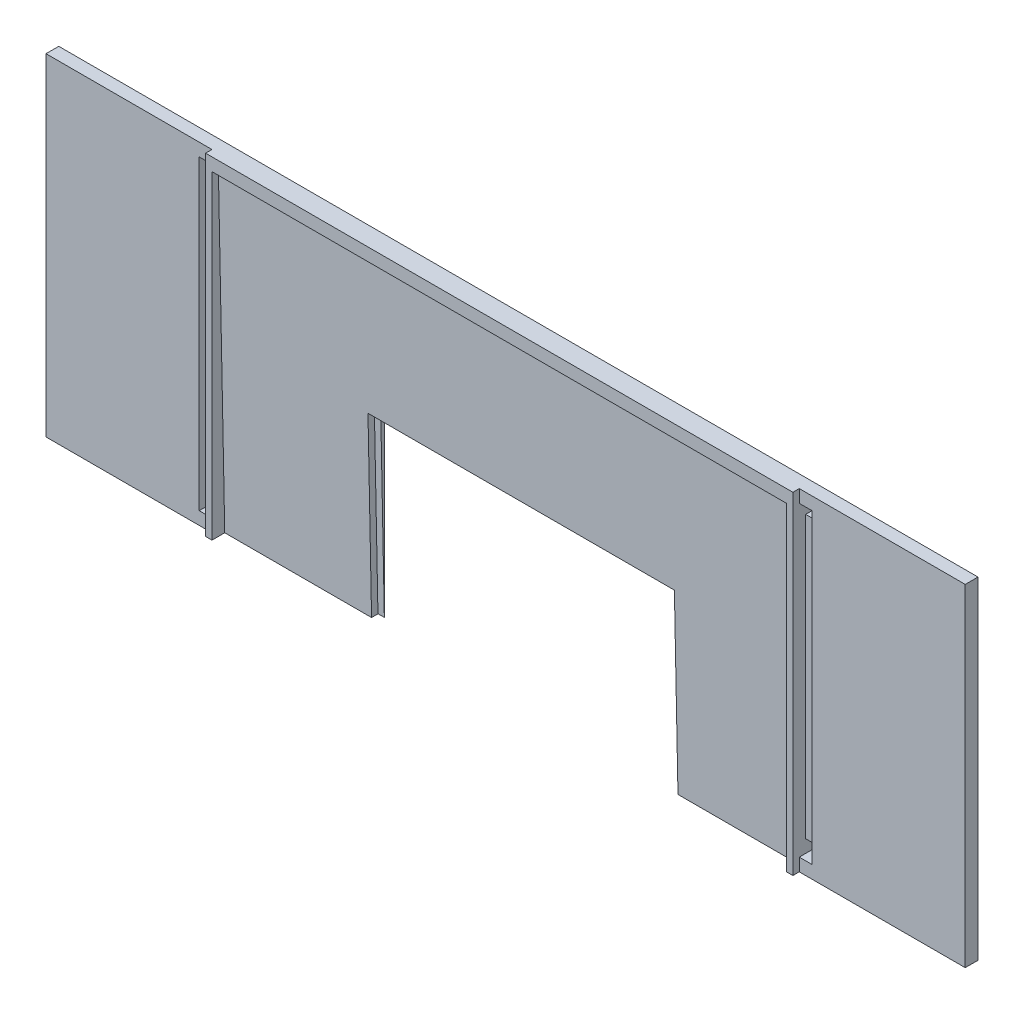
ISO-10303-21;
HEADER;
FILE_DESCRIPTION(('STEP AP214'),'2;1');
FILE_NAME('part.step','',(''),(''),'','','');
FILE_SCHEMA(('AUTOMOTIVE_DESIGN { 1 0 10303 214 1 1 1 1 }'));
ENDSEC;
DATA;
#1=APPLICATION_CONTEXT('core data for automotive mechanical design processes');
#2=APPLICATION_PROTOCOL_DEFINITION('international standard','automotive_design',2000,#1);
#3=PRODUCT_CONTEXT('',#1,'mechanical');
#4=PRODUCT('Part','Part','',(#3));
#5=PRODUCT_RELATED_PRODUCT_CATEGORY('part','',(#4));
#6=PRODUCT_DEFINITION_FORMATION('','',#4);
#7=PRODUCT_DEFINITION_CONTEXT('part definition',#1,'design');
#8=PRODUCT_DEFINITION('design','',#6,#7);
#9=PRODUCT_DEFINITION_SHAPE('','',#8);
#10=(LENGTH_UNIT() NAMED_UNIT(*) SI_UNIT(.MILLI.,.METRE.));
#11=(NAMED_UNIT(*) PLANE_ANGLE_UNIT() SI_UNIT($,.RADIAN.));
#12=(NAMED_UNIT(*) SI_UNIT($,.STERADIAN.) SOLID_ANGLE_UNIT());
#13=UNCERTAINTY_MEASURE_WITH_UNIT(LENGTH_MEASURE(1.E-05),#10,'distance_accuracy_value','');
#14=(GEOMETRIC_REPRESENTATION_CONTEXT(3) GLOBAL_UNCERTAINTY_ASSIGNED_CONTEXT((#13)) GLOBAL_UNIT_ASSIGNED_CONTEXT((#10,
#11,#12)) REPRESENTATION_CONTEXT('',''));
#15=CARTESIAN_POINT('',(0.,0.,0.));
#16=DIRECTION('',(0.,0.,1.));
#17=DIRECTION('',(1.,0.,0.));
#18=AXIS2_PLACEMENT_3D('',#15,#16,#17);
#19=CARTESIAN_POINT('',(0.,0.,-12.7));
#20=DIRECTION('',(0.,0.,1.));
#21=DIRECTION('',(1.,0.,0.));
#22=AXIS2_PLACEMENT_3D('',#19,#20,#21);
#23=PLANE('',#22);
#24=DIRECTION('',(0.,-1.,0.));
#25=VECTOR('',#24,1.);
#26=CARTESIAN_POINT('',(584.200000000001,304.8,-12.7));
#27=LINE('',#26,#25);
#28=CARTESIAN_POINT('',(584.200000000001,279.4,-12.7));
#29=VERTEX_POINT('',#28);
#30=CARTESIAN_POINT('',(584.2,-279.4,-12.7));
#31=VERTEX_POINT('',#30);
#32=EDGE_CURVE('E504',#29,#31,#27,.T.);
#33=ORIENTED_EDGE('',*,*,#32,.T.);
#34=DIRECTION('',(1.,0.,0.));
#35=VECTOR('',#34,1.);
#36=CARTESIAN_POINT('',(609.6,-279.4,-12.7));
#37=LINE('',#36,#35);
#38=CARTESIAN_POINT('',(609.6,-279.4,-12.7));
#39=VERTEX_POINT('',#38);
#40=EDGE_CURVE('E339',#31,#39,#37,.T.);
#41=ORIENTED_EDGE('',*,*,#40,.T.);
#42=DIRECTION('',(0.,1.,0.));
#43=VECTOR('',#42,1.);
#44=CARTESIAN_POINT('',(609.6,304.8,-12.7));
#45=LINE('',#44,#43);
#46=CARTESIAN_POINT('',(609.6,279.4,-12.7));
#47=VERTEX_POINT('',#46);
#48=EDGE_CURVE('E507',#39,#47,#45,.T.);
#49=ORIENTED_EDGE('',*,*,#48,.T.);
#50=DIRECTION('',(-1.,0.,0.));
#51=VECTOR('',#50,1.);
#52=CARTESIAN_POINT('',(609.6,279.4,-12.7));
#53=LINE('',#52,#51);
#54=EDGE_CURVE('E396',#47,#29,#53,.T.);
#55=ORIENTED_EDGE('',*,*,#54,.T.);
#56=EDGE_LOOP('',(#33,#41,#49,#55));
#57=FACE_BOUND('',#56,.T.);
#58=ADVANCED_FACE('F40',(#57),#23,.T.);
#59=CARTESIAN_POINT('',(330.2,-330.2,-25.4));
#60=DIRECTION('',(0.,-1.,0.));
#61=DIRECTION('',(0.,0.,-1.));
#62=AXIS2_PLACEMENT_3D('',#59,#60,#61);
#63=PLANE('',#62);
#64=DIRECTION('',(0.,0.,-1.));
#65=VECTOR('',#64,1.);
#66=CARTESIAN_POINT('',(571.5,-330.2,12.7));
#67=LINE('',#66,#65);
#68=CARTESIAN_POINT('',(571.5,-330.2,12.7));
#69=VERTEX_POINT('',#68);
#70=CARTESIAN_POINT('',(571.5,-330.2,-12.7));
#71=VERTEX_POINT('',#70);
#72=EDGE_CURVE('E464',#69,#71,#67,.T.);
#73=ORIENTED_EDGE('',*,*,#72,.T.);
#74=DIRECTION('',(-1.,0.,0.));
#75=VECTOR('',#74,1.);
#76=CARTESIAN_POINT('',(571.5,-330.2,-12.7));
#77=LINE('',#76,#75);
#78=CARTESIAN_POINT('',(330.2,-330.2,-12.7));
#79=VERTEX_POINT('',#78);
#80=EDGE_CURVE('E419',#71,#79,#77,.T.);
#81=ORIENTED_EDGE('',*,*,#80,.T.);
#82=DIRECTION('',(0.,0.,1.));
#83=VECTOR('',#82,1.);
#84=CARTESIAN_POINT('',(330.2,-330.2,-25.4));
#85=LINE('',#84,#83);
#86=CARTESIAN_POINT('',(330.2,-330.2,-25.4));
#87=VERTEX_POINT('',#86);
#88=EDGE_CURVE('E560',#87,#79,#85,.T.);
#89=ORIENTED_EDGE('',*,*,#88,.F.);
#90=DIRECTION('',(1.,0.,0.));
#91=VECTOR('',#90,1.);
#92=CARTESIAN_POINT('',(330.2,-330.2,-25.4));
#93=LINE('',#92,#91);
#94=CARTESIAN_POINT('',(914.4,-330.2,-25.4));
#95=VERTEX_POINT('',#94);
#96=EDGE_CURVE('E543',#87,#95,#93,.T.);
#97=ORIENTED_EDGE('',*,*,#96,.T.);
#98=DIRECTION('',(0.,0.,1.));
#99=VECTOR('',#98,1.);
#100=CARTESIAN_POINT('',(914.4,-330.2,-25.4));
#101=LINE('',#100,#99);
#102=CARTESIAN_POINT('',(914.4,-330.2,0.));
#103=VERTEX_POINT('',#102);
#104=EDGE_CURVE('E557',#95,#103,#101,.T.);
#105=ORIENTED_EDGE('',*,*,#104,.T.);
#106=DIRECTION('',(1.,0.,0.));
#107=VECTOR('',#106,1.);
#108=CARTESIAN_POINT('',(330.2,-330.2,0.));
#109=LINE('',#108,#107);
#110=CARTESIAN_POINT('',(584.200000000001,-330.2,0.));
#111=VERTEX_POINT('',#110);
#112=EDGE_CURVE('E530',#111,#103,#109,.T.);
#113=ORIENTED_EDGE('',*,*,#112,.F.);
#114=DIRECTION('',(0.,0.,-1.));
#115=VECTOR('',#114,1.);
#116=CARTESIAN_POINT('',(584.200000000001,-330.2,12.7));
#117=LINE('',#116,#115);
#118=CARTESIAN_POINT('',(584.200000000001,-330.2,12.7));
#119=VERTEX_POINT('',#118);
#120=EDGE_CURVE('E461',#119,#111,#117,.T.);
#121=ORIENTED_EDGE('',*,*,#120,.F.);
#122=DIRECTION('',(1.,0.,0.));
#123=VECTOR('',#122,1.);
#124=CARTESIAN_POINT('',(571.5,-330.2,12.7));
#125=LINE('',#124,#123);
#126=EDGE_CURVE('E443',#69,#119,#125,.T.);
#127=ORIENTED_EDGE('',*,*,#126,.F.);
#128=EDGE_LOOP('',(#73,#81,#89,#97,#105,#113,#121,#127));
#129=FACE_BOUND('',#128,.T.);
#130=ADVANCED_FACE('F591',(#129),#63,.T.);
#131=CARTESIAN_POINT('',(330.2,-330.2,-25.4));
#132=DIRECTION('',(-1.,0.,0.));
#133=DIRECTION('',(0.,0.,1.));
#134=AXIS2_PLACEMENT_3D('',#131,#132,#133);
#135=PLANE('',#134);
#136=DIRECTION('',(0.,0.999800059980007,0.0199960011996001));
#137=VECTOR('',#136,1.);
#138=CARTESIAN_POINT('',(330.2,25.6539492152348,-18.2854607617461));
#139=LINE('',#138,#137);
#140=CARTESIAN_POINT('',(330.2,-329.946050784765,-25.3974607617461));
#141=VERTEX_POINT('',#140);
#142=CARTESIAN_POINT('',(330.2,25.3999999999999,-18.2905397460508));
#143=VERTEX_POINT('',#142);
#144=EDGE_CURVE('E58',#141,#143,#139,.T.);
#145=ORIENTED_EDGE('',*,*,#144,.F.);
#146=DIRECTION('',(0.,-0.0199960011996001,0.999800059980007));
#147=VECTOR('',#146,1.);
#148=CARTESIAN_POINT('',(330.2,-315.760851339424,-734.657433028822));
#149=LINE('',#148,#147);
#150=CARTESIAN_POINT('',(330.2,-329.946,-25.4));
#151=VERTEX_POINT('',#150);
#152=EDGE_CURVE('E325',#151,#141,#149,.T.);
#153=ORIENTED_EDGE('',*,*,#152,.F.);
#154=DIRECTION('',(0.,-1.,0.));
#155=VECTOR('',#154,1.);
#156=CARTESIAN_POINT('',(330.2,-330.2,-25.4));
#157=LINE('',#156,#155);
#158=EDGE_CURVE('E541',#151,#87,#157,.T.);
#159=ORIENTED_EDGE('',*,*,#158,.T.);
#160=ORIENTED_EDGE('',*,*,#88,.T.);
#161=DIRECTION('',(0.,0.999800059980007,0.0199960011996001));
#162=VECTOR('',#161,1.);
#163=CARTESIAN_POINT('',(330.2,-330.453898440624,-12.7050779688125));
#164=LINE('',#163,#162);
#165=CARTESIAN_POINT('',(330.2,25.3999999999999,-5.588));
#166=VERTEX_POINT('',#165);
#167=EDGE_CURVE('E428',#79,#166,#164,.T.);
#168=ORIENTED_EDGE('',*,*,#167,.T.);
#169=DIRECTION('',(0.,0.,1.));
#170=VECTOR('',#169,1.);
#171=CARTESIAN_POINT('',(330.2,25.3999999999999,-25.4));
#172=LINE('',#171,#170);
#173=EDGE_CURVE('E563',#143,#166,#172,.T.);
#174=ORIENTED_EDGE('',*,*,#173,.F.);
#175=EDGE_LOOP('',(#145,#153,#159,#160,#168,#174));
#176=FACE_BOUND('',#175,.T.);
#177=ADVANCED_FACE('F651',(#176),#135,.T.);
#178=CARTESIAN_POINT('',(-279.4,25.3999999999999,-25.4));
#179=DIRECTION('',(0.,-1.,0.));
#180=DIRECTION('',(0.,0.,-1.));
#181=AXIS2_PLACEMENT_3D('',#178,#179,#180);
#182=PLANE('',#181);
#183=DIRECTION('',(-1.,0.,0.));
#184=VECTOR('',#183,1.);
#185=CARTESIAN_POINT('',(-279.4,25.3999999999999,-18.2905397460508));
#186=LINE('',#185,#184);
#187=CARTESIAN_POINT('',(-279.4,25.3999999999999,-18.2905397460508));
#188=VERTEX_POINT('',#187);
#189=EDGE_CURVE('E66',#143,#188,#186,.T.);
#190=ORIENTED_EDGE('',*,*,#189,.F.);
#191=ORIENTED_EDGE('',*,*,#173,.T.);
#192=DIRECTION('',(-1.,0.,0.));
#193=VECTOR('',#192,1.);
#194=CARTESIAN_POINT('',(-279.4,25.3999999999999,-5.588));
#195=LINE('',#194,#193);
#196=CARTESIAN_POINT('',(-279.4,25.3999999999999,-5.588));
#197=VERTEX_POINT('',#196);
#198=EDGE_CURVE('E425',#166,#197,#195,.T.);
#199=ORIENTED_EDGE('',*,*,#198,.T.);
#200=DIRECTION('',(0.,0.,1.));
#201=VECTOR('',#200,1.);
#202=CARTESIAN_POINT('',(-279.4,25.3999999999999,-25.4));
#203=LINE('',#202,#201);
#204=EDGE_CURVE('E565',#188,#197,#203,.T.);
#205=ORIENTED_EDGE('',*,*,#204,.F.);
#206=EDGE_LOOP('',(#190,#191,#199,#205));
#207=FACE_BOUND('',#206,.T.);
#208=ADVANCED_FACE('F650',(#207),#182,.T.);
#209=CARTESIAN_POINT('',(-279.4,-330.2,-25.4));
#210=DIRECTION('',(1.,0.,0.));
#211=DIRECTION('',(0.,0.,-1.));
#212=AXIS2_PLACEMENT_3D('',#209,#210,#211);
#213=PLANE('',#212);
#214=DIRECTION('',(0.,-0.999800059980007,-0.0199960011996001));
#215=VECTOR('',#214,1.);
#216=CARTESIAN_POINT('',(-279.4,25.6539492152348,-18.2854607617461));
#217=LINE('',#216,#215);
#218=CARTESIAN_POINT('',(-279.4,-329.946050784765,-25.3974607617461));
#219=VERTEX_POINT('',#218);
#220=EDGE_CURVE('E320',#188,#219,#217,.T.);
#221=ORIENTED_EDGE('',*,*,#220,.F.);
#222=ORIENTED_EDGE('',*,*,#204,.T.);
#223=DIRECTION('',(0.,-0.999800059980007,-0.0199960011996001));
#224=VECTOR('',#223,1.);
#225=CARTESIAN_POINT('',(-279.4,-330.453898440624,-12.7050779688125));
#226=LINE('',#225,#224);
#227=CARTESIAN_POINT('',(-279.4,-330.2,-12.7));
#228=VERTEX_POINT('',#227);
#229=EDGE_CURVE('E422',#197,#228,#226,.T.);
#230=ORIENTED_EDGE('',*,*,#229,.T.);
#231=DIRECTION('',(0.,0.,1.));
#232=VECTOR('',#231,1.);
#233=CARTESIAN_POINT('',(-279.4,-330.2,-25.4));
#234=LINE('',#233,#232);
#235=CARTESIAN_POINT('',(-279.4,-330.2,-25.4));
#236=VERTEX_POINT('',#235);
#237=EDGE_CURVE('E567',#236,#228,#234,.T.);
#238=ORIENTED_EDGE('',*,*,#237,.F.);
#239=DIRECTION('',(0.,1.,0.));
#240=VECTOR('',#239,1.);
#241=CARTESIAN_POINT('',(-279.4,-330.2,-25.4));
#242=LINE('',#241,#240);
#243=CARTESIAN_POINT('',(-279.4,-329.946,-25.4));
#244=VERTEX_POINT('',#243);
#245=EDGE_CURVE('E539',#236,#244,#242,.T.);
#246=ORIENTED_EDGE('',*,*,#245,.T.);
#247=DIRECTION('',(0.,-0.0199960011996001,0.999800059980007));
#248=VECTOR('',#247,1.);
#249=CARTESIAN_POINT('',(-279.4,-315.760851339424,-734.657433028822));
#250=LINE('',#249,#248);
#251=EDGE_CURVE('E314',#244,#219,#250,.T.);
#252=ORIENTED_EDGE('',*,*,#251,.T.);
#253=EDGE_LOOP('',(#221,#222,#230,#238,#246,#252));
#254=FACE_BOUND('',#253,.T.);
#255=ADVANCED_FACE('F649',(#254),#213,.T.);
#256=CARTESIAN_POINT('',(-914.4,-330.2,-25.4));
#257=DIRECTION('',(0.,-1.,0.));
#258=DIRECTION('',(0.,0.,-1.));
#259=AXIS2_PLACEMENT_3D('',#256,#257,#258);
#260=PLANE('',#259);
#261=ORIENTED_EDGE('',*,*,#237,.T.);
#262=CARTESIAN_POINT('',(-571.5,-330.2,-12.7));
#263=VERTEX_POINT('',#262);
#264=EDGE_CURVE('E417',#228,#263,#77,.T.);
#265=ORIENTED_EDGE('',*,*,#264,.T.);
#266=DIRECTION('',(0.,0.,-1.));
#267=VECTOR('',#266,1.);
#268=CARTESIAN_POINT('',(-571.5,-330.2,12.7));
#269=LINE('',#268,#267);
#270=CARTESIAN_POINT('',(-571.5,-330.2,12.7));
#271=VERTEX_POINT('',#270);
#272=EDGE_CURVE('E472',#271,#263,#269,.T.);
#273=ORIENTED_EDGE('',*,*,#272,.F.);
#274=DIRECTION('',(1.,0.,0.));
#275=VECTOR('',#274,1.);
#276=CARTESIAN_POINT('',(-584.2,-330.2,12.7));
#277=LINE('',#276,#275);
#278=CARTESIAN_POINT('',(-584.2,-330.2,12.7));
#279=VERTEX_POINT('',#278);
#280=EDGE_CURVE('E434',#279,#271,#277,.T.);
#281=ORIENTED_EDGE('',*,*,#280,.F.);
#282=DIRECTION('',(0.,0.,-1.));
#283=VECTOR('',#282,1.);
#284=CARTESIAN_POINT('',(-584.2,-330.2,12.7));
#285=LINE('',#284,#283);
#286=CARTESIAN_POINT('',(-584.2,-330.2,0.));
#287=VERTEX_POINT('',#286);
#288=EDGE_CURVE('E474',#279,#287,#285,.T.);
#289=ORIENTED_EDGE('',*,*,#288,.T.);
#290=DIRECTION('',(1.,0.,0.));
#291=VECTOR('',#290,1.);
#292=CARTESIAN_POINT('',(-914.4,-330.2,0.));
#293=LINE('',#292,#291);
#294=CARTESIAN_POINT('',(-914.4,-330.2,0.));
#295=VERTEX_POINT('',#294);
#296=EDGE_CURVE('E554',#295,#287,#293,.T.);
#297=ORIENTED_EDGE('',*,*,#296,.F.);
#298=DIRECTION('',(0.,0.,1.));
#299=VECTOR('',#298,1.);
#300=CARTESIAN_POINT('',(-914.4,-330.2,-25.4));
#301=LINE('',#300,#299);
#302=CARTESIAN_POINT('',(-914.4,-330.2,-25.4));
#303=VERTEX_POINT('',#302);
#304=EDGE_CURVE('E570',#303,#295,#301,.T.);
#305=ORIENTED_EDGE('',*,*,#304,.F.);
#306=DIRECTION('',(1.,0.,0.));
#307=VECTOR('',#306,1.);
#308=CARTESIAN_POINT('',(-914.4,-330.2,-25.4));
#309=LINE('',#308,#307);
#310=EDGE_CURVE('E536',#303,#236,#309,.T.);
#311=ORIENTED_EDGE('',*,*,#310,.T.);
#312=EDGE_LOOP('',(#261,#265,#273,#281,#289,#297,#305,#311));
#313=FACE_BOUND('',#312,.T.);
#314=ADVANCED_FACE('F646',(#313),#260,.T.);
#315=CARTESIAN_POINT('',(0.,0.,0.));
#316=DIRECTION('',(0.,0.,-1.));
#317=DIRECTION('',(-1.,0.,0.));
#318=AXIS2_PLACEMENT_3D('',#315,#316,#317);
#319=PLANE('',#318);
#320=DIRECTION('',(0.,-1.,0.));
#321=VECTOR('',#320,1.);
#322=CARTESIAN_POINT('',(-584.2,330.2,0.));
#323=LINE('',#322,#321);
#324=CARTESIAN_POINT('',(-584.2,330.2,0.));
#325=VERTEX_POINT('',#324);
#326=CARTESIAN_POINT('',(-584.2,304.8,0.));
#327=VERTEX_POINT('',#326);
#328=EDGE_CURVE('E51',#325,#327,#323,.T.);
#329=ORIENTED_EDGE('',*,*,#328,.F.);
#330=DIRECTION('',(-1.,0.,0.));
#331=VECTOR('',#330,1.);
#332=CARTESIAN_POINT('',(-914.4,330.2,0.));
#333=LINE('',#332,#331);
#334=CARTESIAN_POINT('',(-914.4,330.2,0.));
#335=VERTEX_POINT('',#334);
#336=EDGE_CURVE('E548',#325,#335,#333,.T.);
#337=ORIENTED_EDGE('',*,*,#336,.T.);
#338=DIRECTION('',(0.,-1.,0.));
#339=VECTOR('',#338,1.);
#340=CARTESIAN_POINT('',(-914.4,-330.2,0.));
#341=LINE('',#340,#339);
#342=EDGE_CURVE('E551',#335,#295,#341,.T.);
#343=ORIENTED_EDGE('',*,*,#342,.T.);
#344=ORIENTED_EDGE('',*,*,#296,.T.);
#345=CARTESIAN_POINT('',(-584.2,-304.8,0.));
#346=VERTEX_POINT('',#345);
#347=EDGE_CURVE('E11',#346,#287,#323,.T.);
#348=ORIENTED_EDGE('',*,*,#347,.F.);
#349=DIRECTION('',(1.,0.,0.));
#350=VECTOR('',#349,1.);
#351=CARTESIAN_POINT('',(-609.6,-304.8,0.));
#352=LINE('',#351,#350);
#353=CARTESIAN_POINT('',(-609.6,-304.8,0.));
#354=VERTEX_POINT('',#353);
#355=EDGE_CURVE('E488',#354,#346,#352,.T.);
#356=ORIENTED_EDGE('',*,*,#355,.F.);
#357=DIRECTION('',(0.,-1.,0.));
#358=VECTOR('',#357,1.);
#359=CARTESIAN_POINT('',(-609.6,-304.8,0.));
#360=LINE('',#359,#358);
#361=CARTESIAN_POINT('',(-609.6,304.8,0.));
#362=VERTEX_POINT('',#361);
#363=EDGE_CURVE('E486',#362,#354,#360,.T.);
#364=ORIENTED_EDGE('',*,*,#363,.F.);
#365=DIRECTION('',(-1.,0.,0.));
#366=VECTOR('',#365,1.);
#367=CARTESIAN_POINT('',(-609.6,304.8,0.));
#368=LINE('',#367,#366);
#369=EDGE_CURVE('E482',#327,#362,#368,.T.);
#370=ORIENTED_EDGE('',*,*,#369,.F.);
#371=EDGE_LOOP('',(#329,#337,#343,#344,#348,#356,#364,#370));
#372=FACE_BOUND('',#371,.T.);
#373=ADVANCED_FACE('F600',(#372),#319,.F.);
#374=DIRECTION('',(0.,1.,0.));
#375=VECTOR('',#374,1.);
#376=CARTESIAN_POINT('',(584.200000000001,330.2,0.));
#377=LINE('',#376,#375);
#378=CARTESIAN_POINT('',(584.200000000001,-304.8,0.));
#379=VERTEX_POINT('',#378);
#380=EDGE_CURVE('E435',#111,#379,#377,.T.);
#381=ORIENTED_EDGE('',*,*,#380,.F.);
#382=ORIENTED_EDGE('',*,*,#112,.T.);
#383=DIRECTION('',(0.,1.,0.));
#384=VECTOR('',#383,1.);
#385=CARTESIAN_POINT('',(914.4,-330.2,0.));
#386=LINE('',#385,#384);
#387=CARTESIAN_POINT('',(914.4,330.2,0.));
#388=VERTEX_POINT('',#387);
#389=EDGE_CURVE('E496',#103,#388,#386,.T.);
#390=ORIENTED_EDGE('',*,*,#389,.T.);
#391=CARTESIAN_POINT('',(584.200000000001,330.2,0.));
#392=VERTEX_POINT('',#391);
#393=EDGE_CURVE('E549',#388,#392,#333,.T.);
#394=ORIENTED_EDGE('',*,*,#393,.T.);
#395=CARTESIAN_POINT('',(584.200000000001,304.8,0.));
#396=VERTEX_POINT('',#395);
#397=EDGE_CURVE('E49',#396,#392,#377,.T.);
#398=ORIENTED_EDGE('',*,*,#397,.F.);
#399=DIRECTION('',(-1.,0.,0.));
#400=VECTOR('',#399,1.);
#401=CARTESIAN_POINT('',(584.200000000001,304.8,0.));
#402=LINE('',#401,#400);
#403=CARTESIAN_POINT('',(609.6,304.8,0.));
#404=VERTEX_POINT('',#403);
#405=EDGE_CURVE('E508',#404,#396,#402,.T.);
#406=ORIENTED_EDGE('',*,*,#405,.F.);
#407=DIRECTION('',(0.,1.,0.));
#408=VECTOR('',#407,1.);
#409=CARTESIAN_POINT('',(609.6,304.8,0.));
#410=LINE('',#409,#408);
#411=CARTESIAN_POINT('',(609.6,-304.8,0.));
#412=VERTEX_POINT('',#411);
#413=EDGE_CURVE('E514',#412,#404,#410,.T.);
#414=ORIENTED_EDGE('',*,*,#413,.F.);
#415=DIRECTION('',(1.,0.,0.));
#416=VECTOR('',#415,1.);
#417=CARTESIAN_POINT('',(584.200000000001,-304.8,0.));
#418=LINE('',#417,#416);
#419=EDGE_CURVE('E477',#379,#412,#418,.T.);
#420=ORIENTED_EDGE('',*,*,#419,.F.);
#421=EDGE_LOOP('',(#381,#382,#390,#394,#398,#406,#414,#420));
#422=FACE_BOUND('',#421,.T.);
#423=ADVANCED_FACE('F586',(#422),#319,.F.);
#424=CARTESIAN_POINT('',(914.4,-330.2,-25.4));
#425=DIRECTION('',(1.,0.,0.));
#426=DIRECTION('',(0.,0.,-1.));
#427=AXIS2_PLACEMENT_3D('',#424,#425,#426);
#428=PLANE('',#427);
#429=ORIENTED_EDGE('',*,*,#389,.F.);
#430=ORIENTED_EDGE('',*,*,#104,.F.);
#431=DIRECTION('',(0.,1.,0.));
#432=VECTOR('',#431,1.);
#433=CARTESIAN_POINT('',(914.4,-330.2,-25.4));
#434=LINE('',#433,#432);
#435=CARTESIAN_POINT('',(914.4,330.2,-25.4));
#436=VERTEX_POINT('',#435);
#437=EDGE_CURVE('E526',#95,#436,#434,.T.);
#438=ORIENTED_EDGE('',*,*,#437,.T.);
#439=DIRECTION('',(0.,0.,1.));
#440=VECTOR('',#439,1.);
#441=CARTESIAN_POINT('',(914.4,330.2,-25.4));
#442=LINE('',#441,#440);
#443=EDGE_CURVE('E44',#436,#388,#442,.T.);
#444=ORIENTED_EDGE('',*,*,#443,.T.);
#445=EDGE_LOOP('',(#429,#430,#438,#444));
#446=FACE_BOUND('',#445,.T.);
#447=ADVANCED_FACE('F42',(#446),#428,.T.);
#448=CARTESIAN_POINT('',(-914.4,-330.2,-25.4));
#449=DIRECTION('',(-1.,0.,0.));
#450=DIRECTION('',(0.,0.,1.));
#451=AXIS2_PLACEMENT_3D('',#448,#449,#450);
#452=PLANE('',#451);
#453=ORIENTED_EDGE('',*,*,#342,.F.);
#454=DIRECTION('',(0.,0.,1.));
#455=VECTOR('',#454,1.);
#456=CARTESIAN_POINT('',(-914.4,330.2,-25.4));
#457=LINE('',#456,#455);
#458=CARTESIAN_POINT('',(-914.4,330.2,-25.4));
#459=VERTEX_POINT('',#458);
#460=EDGE_CURVE('E571',#459,#335,#457,.T.);
#461=ORIENTED_EDGE('',*,*,#460,.F.);
#462=DIRECTION('',(0.,-1.,0.));
#463=VECTOR('',#462,1.);
#464=CARTESIAN_POINT('',(-914.4,-330.2,-25.4));
#465=LINE('',#464,#463);
#466=EDGE_CURVE('E533',#459,#303,#465,.T.);
#467=ORIENTED_EDGE('',*,*,#466,.T.);
#468=ORIENTED_EDGE('',*,*,#304,.T.);
#469=EDGE_LOOP('',(#453,#461,#467,#468));
#470=FACE_BOUND('',#469,.T.);
#471=ADVANCED_FACE('F597',(#470),#452,.T.);
#472=CARTESIAN_POINT('',(-914.4,330.2,-25.4));
#473=DIRECTION('',(0.,1.,0.));
#474=DIRECTION('',(0.,0.,1.));
#475=AXIS2_PLACEMENT_3D('',#472,#473,#474);
#476=PLANE('',#475);
#477=ORIENTED_EDGE('',*,*,#393,.F.);
#478=ORIENTED_EDGE('',*,*,#443,.F.);
#479=DIRECTION('',(-1.,0.,0.));
#480=VECTOR('',#479,1.);
#481=CARTESIAN_POINT('',(-914.4,330.2,-25.4));
#482=LINE('',#481,#480);
#483=EDGE_CURVE('E529',#436,#459,#482,.T.);
#484=ORIENTED_EDGE('',*,*,#483,.T.);
#485=ORIENTED_EDGE('',*,*,#460,.T.);
#486=ORIENTED_EDGE('',*,*,#336,.F.);
#487=DIRECTION('',(0.,0.,-1.));
#488=VECTOR('',#487,1.);
#489=CARTESIAN_POINT('',(-584.2,330.2,12.7));
#490=LINE('',#489,#488);
#491=CARTESIAN_POINT('',(-584.2,330.2,12.7));
#492=VERTEX_POINT('',#491);
#493=EDGE_CURVE('E448',#492,#325,#490,.T.);
#494=ORIENTED_EDGE('',*,*,#493,.F.);
#495=DIRECTION('',(-1.,0.,0.));
#496=VECTOR('',#495,1.);
#497=CARTESIAN_POINT('',(-584.2,330.2,12.7));
#498=LINE('',#497,#496);
#499=CARTESIAN_POINT('',(584.200000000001,330.2,12.7));
#500=VERTEX_POINT('',#499);
#501=EDGE_CURVE('E447',#500,#492,#498,.T.);
#502=ORIENTED_EDGE('',*,*,#501,.F.);
#503=DIRECTION('',(0.,0.,-1.));
#504=VECTOR('',#503,1.);
#505=CARTESIAN_POINT('',(584.200000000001,330.2,12.7));
#506=LINE('',#505,#504);
#507=EDGE_CURVE('E458',#500,#392,#506,.T.);
#508=ORIENTED_EDGE('',*,*,#507,.T.);
#509=EDGE_LOOP('',(#477,#478,#484,#485,#486,#494,#502,#508));
#510=FACE_BOUND('',#509,.T.);
#511=ADVANCED_FACE('F581',(#510),#476,.T.);
#512=CARTESIAN_POINT('',(0.,0.,-25.4));
#513=DIRECTION('',(0.,0.,-1.));
#514=DIRECTION('',(-1.,0.,0.));
#515=AXIS2_PLACEMENT_3D('',#512,#513,#514);
#516=PLANE('',#515);
#517=ORIENTED_EDGE('',*,*,#158,.F.);
#518=DIRECTION('',(1.,0.,0.));
#519=VECTOR('',#518,1.);
#520=CARTESIAN_POINT('',(317.5,-329.946,-25.4));
#521=LINE('',#520,#519);
#522=CARTESIAN_POINT('',(317.5,-329.946,-25.4));
#523=VERTEX_POINT('',#522);
#524=EDGE_CURVE('E322',#523,#151,#521,.T.);
#525=ORIENTED_EDGE('',*,*,#524,.F.);
#526=DIRECTION('',(0.,-1.,0.));
#527=VECTOR('',#526,1.);
#528=CARTESIAN_POINT('',(317.5,27.1416878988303,-25.4));
#529=LINE('',#528,#527);
#530=CARTESIAN_POINT('',(317.5,13.0937002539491,-25.4));
#531=VERTEX_POINT('',#530);
#532=EDGE_CURVE('E327',#531,#523,#529,.T.);
#533=ORIENTED_EDGE('',*,*,#532,.F.);
#534=DIRECTION('',(1.,0.,0.));
#535=VECTOR('',#534,1.);
#536=CARTESIAN_POINT('',(-266.7,13.0937002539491,-25.4));
#537=LINE('',#536,#535);
#538=CARTESIAN_POINT('',(-266.7,13.0937002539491,-25.4));
#539=VERTEX_POINT('',#538);
#540=EDGE_CURVE('E299',#539,#531,#537,.T.);
#541=ORIENTED_EDGE('',*,*,#540,.F.);
#542=DIRECTION('',(0.,1.,0.));
#543=VECTOR('',#542,1.);
#544=CARTESIAN_POINT('',(-266.7,27.1416878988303,-25.4));
#545=LINE('',#544,#543);
#546=CARTESIAN_POINT('',(-266.7,-329.946,-25.4));
#547=VERTEX_POINT('',#546);
#548=EDGE_CURVE('E289',#547,#539,#545,.T.);
#549=ORIENTED_EDGE('',*,*,#548,.F.);
#550=DIRECTION('',(1.,0.,0.));
#551=VECTOR('',#550,1.);
#552=CARTESIAN_POINT('',(-279.4,-329.946,-25.4));
#553=LINE('',#552,#551);
#554=EDGE_CURVE('E296',#244,#547,#553,.T.);
#555=ORIENTED_EDGE('',*,*,#554,.F.);
#556=ORIENTED_EDGE('',*,*,#245,.F.);
#557=ORIENTED_EDGE('',*,*,#310,.F.);
#558=ORIENTED_EDGE('',*,*,#466,.F.);
#559=ORIENTED_EDGE('',*,*,#483,.F.);
#560=ORIENTED_EDGE('',*,*,#437,.F.);
#561=ORIENTED_EDGE('',*,*,#96,.F.);
#562=EDGE_LOOP('',(#517,#525,#533,#541,#549,#555,#556,#557,#558,#559,#560,#561));
#563=FACE_BOUND('',#562,.T.);
#564=DIRECTION('',(0.,-1.,0.));
#565=VECTOR('',#564,1.);
#566=CARTESIAN_POINT('',(-584.2,304.8,-25.4));
#567=LINE('',#566,#565);
#568=CARTESIAN_POINT('',(-584.2,304.8,-25.4));
#569=VERTEX_POINT('',#568);
#570=CARTESIAN_POINT('',(-584.2,279.4,-25.4));
#571=VERTEX_POINT('',#570);
#572=EDGE_CURVE('E338',#569,#571,#567,.T.);
#573=ORIENTED_EDGE('',*,*,#572,.F.);
#574=DIRECTION('',(1.,0.,0.));
#575=VECTOR('',#574,1.);
#576=CARTESIAN_POINT('',(-584.2,304.8,-25.4));
#577=LINE('',#576,#575);
#578=CARTESIAN_POINT('',(-609.6,304.8,-25.4));
#579=VERTEX_POINT('',#578);
#580=EDGE_CURVE('E383',#579,#569,#577,.T.);
#581=ORIENTED_EDGE('',*,*,#580,.F.);
#582=DIRECTION('',(0.,1.,0.));
#583=VECTOR('',#582,1.);
#584=CARTESIAN_POINT('',(-609.6,304.8,-25.4));
#585=LINE('',#584,#583);
#586=CARTESIAN_POINT('',(-609.6,279.4,-25.4));
#587=VERTEX_POINT('',#586);
#588=EDGE_CURVE('E388',#587,#579,#585,.T.);
#589=ORIENTED_EDGE('',*,*,#588,.F.);
#590=DIRECTION('',(-1.,0.,0.));
#591=VECTOR('',#590,1.);
#592=CARTESIAN_POINT('',(-584.2,279.4,-25.4));
#593=LINE('',#592,#591);
#594=EDGE_CURVE('E385',#571,#587,#593,.T.);
#595=ORIENTED_EDGE('',*,*,#594,.F.);
#596=EDGE_LOOP('',(#573,#581,#589,#595));
#597=FACE_BOUND('',#596,.T.);
#598=DIRECTION('',(0.,-1.,0.));
#599=VECTOR('',#598,1.);
#600=CARTESIAN_POINT('',(-584.2,-279.4,-25.4));
#601=LINE('',#600,#599);
#602=CARTESIAN_POINT('',(-584.2,-279.4,-25.4));
#603=VERTEX_POINT('',#602);
#604=CARTESIAN_POINT('',(-584.2,-304.8,-25.4));
#605=VERTEX_POINT('',#604);
#606=EDGE_CURVE('E365',#603,#605,#601,.T.);
#607=ORIENTED_EDGE('',*,*,#606,.F.);
#608=DIRECTION('',(1.,0.,0.));
#609=VECTOR('',#608,1.);
#610=CARTESIAN_POINT('',(-584.2,-279.4,-25.4));
#611=LINE('',#610,#609);
#612=CARTESIAN_POINT('',(-609.6,-279.4,-25.4));
#613=VERTEX_POINT('',#612);
#614=EDGE_CURVE('E364',#613,#603,#611,.T.);
#615=ORIENTED_EDGE('',*,*,#614,.F.);
#616=DIRECTION('',(0.,1.,0.));
#617=VECTOR('',#616,1.);
#618=CARTESIAN_POINT('',(-609.6,-279.4,-25.4));
#619=LINE('',#618,#617);
#620=CARTESIAN_POINT('',(-609.6,-304.8,-25.4));
#621=VERTEX_POINT('',#620);
#622=EDGE_CURVE('E372',#621,#613,#619,.T.);
#623=ORIENTED_EDGE('',*,*,#622,.F.);
#624=DIRECTION('',(-1.,0.,0.));
#625=VECTOR('',#624,1.);
#626=CARTESIAN_POINT('',(-584.2,-304.8,-25.4));
#627=LINE('',#626,#625);
#628=EDGE_CURVE('E368',#605,#621,#627,.T.);
#629=ORIENTED_EDGE('',*,*,#628,.F.);
#630=EDGE_LOOP('',(#607,#615,#623,#629));
#631=FACE_BOUND('',#630,.T.);
#632=DIRECTION('',(0.,-1.,0.));
#633=VECTOR('',#632,1.);
#634=CARTESIAN_POINT('',(609.6,-279.4,-25.4));
#635=LINE('',#634,#633);
#636=CARTESIAN_POINT('',(609.6,-279.4,-25.4));
#637=VERTEX_POINT('',#636);
#638=CARTESIAN_POINT('',(609.6,-304.8,-25.4));
#639=VERTEX_POINT('',#638);
#640=EDGE_CURVE('E344',#637,#639,#635,.T.);
#641=ORIENTED_EDGE('',*,*,#640,.F.);
#642=DIRECTION('',(1.,0.,0.));
#643=VECTOR('',#642,1.);
#644=CARTESIAN_POINT('',(609.6,-279.4,-25.4));
#645=LINE('',#644,#643);
#646=CARTESIAN_POINT('',(584.2,-279.4,-25.4));
#647=VERTEX_POINT('',#646);
#648=EDGE_CURVE('E343',#647,#637,#645,.T.);
#649=ORIENTED_EDGE('',*,*,#648,.F.);
#650=DIRECTION('',(0.,1.,0.));
#651=VECTOR('',#650,1.);
#652=CARTESIAN_POINT('',(584.2,-279.4,-25.4));
#653=LINE('',#652,#651);
#654=CARTESIAN_POINT('',(584.2,-304.8,-25.4));
#655=VERTEX_POINT('',#654);
#656=EDGE_CURVE('E351',#655,#647,#653,.T.);
#657=ORIENTED_EDGE('',*,*,#656,.F.);
#658=DIRECTION('',(-1.,0.,0.));
#659=VECTOR('',#658,1.);
#660=CARTESIAN_POINT('',(609.6,-304.8,-25.4));
#661=LINE('',#660,#659);
#662=EDGE_CURVE('E347',#639,#655,#661,.T.);
#663=ORIENTED_EDGE('',*,*,#662,.F.);
#664=EDGE_LOOP('',(#641,#649,#657,#663));
#665=FACE_BOUND('',#664,.T.);
#666=DIRECTION('',(0.,-1.,0.));
#667=VECTOR('',#666,1.);
#668=CARTESIAN_POINT('',(609.6,304.8,-25.4));
#669=LINE('',#668,#667);
#670=CARTESIAN_POINT('',(609.6,304.8,-25.4));
#671=VERTEX_POINT('',#670);
#672=CARTESIAN_POINT('',(609.6,279.4,-25.4));
#673=VERTEX_POINT('',#672);
#674=EDGE_CURVE('E358',#671,#673,#669,.T.);
#675=ORIENTED_EDGE('',*,*,#674,.F.);
#676=DIRECTION('',(1.,0.,0.));
#677=VECTOR('',#676,1.);
#678=CARTESIAN_POINT('',(609.6,304.8,-25.4));
#679=LINE('',#678,#677);
#680=CARTESIAN_POINT('',(584.2,304.8,-25.4));
#681=VERTEX_POINT('',#680);
#682=EDGE_CURVE('E400',#681,#671,#679,.T.);
#683=ORIENTED_EDGE('',*,*,#682,.F.);
#684=DIRECTION('',(0.,1.,0.));
#685=VECTOR('',#684,1.);
#686=CARTESIAN_POINT('',(584.2,304.8,-25.4));
#687=LINE('',#686,#685);
#688=CARTESIAN_POINT('',(584.2,279.4,-25.4));
#689=VERTEX_POINT('',#688);
#690=EDGE_CURVE('E405',#689,#681,#687,.T.);
#691=ORIENTED_EDGE('',*,*,#690,.F.);
#692=DIRECTION('',(-1.,0.,0.));
#693=VECTOR('',#692,1.);
#694=CARTESIAN_POINT('',(609.6,279.4,-25.4));
#695=LINE('',#694,#693);
#696=EDGE_CURVE('E402',#673,#689,#695,.T.);
#697=ORIENTED_EDGE('',*,*,#696,.F.);
#698=EDGE_LOOP('',(#675,#683,#691,#697));
#699=FACE_BOUND('',#698,.T.);
#700=ADVANCED_FACE('F292',(#563,#597,#631,#665,#699),#516,.T.);
#701=CARTESIAN_POINT('',(584.200000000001,304.8,-12.7));
#702=DIRECTION('',(-1.,0.,0.));
#703=DIRECTION('',(0.,0.,1.));
#704=AXIS2_PLACEMENT_3D('',#701,#702,#703);
#705=PLANE('',#704);
#706=DIRECTION('',(0.,0.,1.));
#707=VECTOR('',#706,1.);
#708=CARTESIAN_POINT('',(584.200000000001,304.8,-12.7));
#709=LINE('',#708,#707);
#710=EDGE_CURVE('E489',#681,#396,#709,.T.);
#711=ORIENTED_EDGE('',*,*,#710,.T.);
#712=ORIENTED_EDGE('',*,*,#397,.T.);
#713=ORIENTED_EDGE('',*,*,#507,.F.);
#714=DIRECTION('',(0.,1.,0.));
#715=VECTOR('',#714,1.);
#716=CARTESIAN_POINT('',(584.200000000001,330.2,12.7));
#717=LINE('',#716,#715);
#718=EDGE_CURVE('E445',#119,#500,#717,.T.);
#719=ORIENTED_EDGE('',*,*,#718,.F.);
#720=ORIENTED_EDGE('',*,*,#120,.T.);
#721=ORIENTED_EDGE('',*,*,#380,.T.);
#722=DIRECTION('',(0.,0.,1.));
#723=VECTOR('',#722,1.);
#724=CARTESIAN_POINT('',(584.200000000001,-304.8,-12.7));
#725=LINE('',#724,#723);
#726=EDGE_CURVE('E511',#655,#379,#725,.T.);
#727=ORIENTED_EDGE('',*,*,#726,.F.);
#728=ORIENTED_EDGE('',*,*,#656,.T.);
#729=DIRECTION('',(0.,0.,-1.));
#730=VECTOR('',#729,1.);
#731=CARTESIAN_POINT('',(584.2,-279.4,-12.7));
#732=LINE('',#731,#730);
#733=EDGE_CURVE('E342',#31,#647,#732,.T.);
#734=ORIENTED_EDGE('',*,*,#733,.F.);
#735=ORIENTED_EDGE('',*,*,#32,.F.);
#736=DIRECTION('',(0.,0.,-1.));
#737=VECTOR('',#736,1.);
#738=CARTESIAN_POINT('',(584.2,279.4,-12.7));
#739=LINE('',#738,#737);
#740=EDGE_CURVE('E410',#29,#689,#739,.T.);
#741=ORIENTED_EDGE('',*,*,#740,.T.);
#742=ORIENTED_EDGE('',*,*,#690,.T.);
#743=EDGE_LOOP('',(#711,#712,#713,#719,#720,#721,#727,#728,#734,#735,#741,#742));
#744=FACE_BOUND('',#743,.T.);
#745=ADVANCED_FACE('F613',(#744),#705,.F.);
#746=CARTESIAN_POINT('',(584.200000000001,304.8,-12.7));
#747=DIRECTION('',(0.,1.,0.));
#748=DIRECTION('',(0.,0.,1.));
#749=AXIS2_PLACEMENT_3D('',#746,#747,#748);
#750=PLANE('',#749);
#751=ORIENTED_EDGE('',*,*,#405,.T.);
#752=ORIENTED_EDGE('',*,*,#710,.F.);
#753=ORIENTED_EDGE('',*,*,#682,.T.);
#754=DIRECTION('',(0.,0.,1.));
#755=VECTOR('',#754,1.);
#756=CARTESIAN_POINT('',(609.6,304.8,-12.7));
#757=LINE('',#756,#755);
#758=EDGE_CURVE('E521',#671,#404,#757,.T.);
#759=ORIENTED_EDGE('',*,*,#758,.T.);
#760=EDGE_LOOP('',(#751,#752,#753,#759));
#761=FACE_BOUND('',#760,.T.);
#762=ADVANCED_FACE('F617',(#761),#750,.F.);
#763=CARTESIAN_POINT('',(609.6,304.8,-12.7));
#764=DIRECTION('',(1.,0.,0.));
#765=DIRECTION('',(0.,1.,0.));
#766=AXIS2_PLACEMENT_3D('',#763,#764,#765);
#767=PLANE('',#766);
#768=ORIENTED_EDGE('',*,*,#413,.T.);
#769=ORIENTED_EDGE('',*,*,#758,.F.);
#770=ORIENTED_EDGE('',*,*,#674,.T.);
#771=DIRECTION('',(0.,0.,-1.));
#772=VECTOR('',#771,1.);
#773=CARTESIAN_POINT('',(609.6,279.4,-12.7));
#774=LINE('',#773,#772);
#775=EDGE_CURVE('E399',#47,#673,#774,.T.);
#776=ORIENTED_EDGE('',*,*,#775,.F.);
#777=ORIENTED_EDGE('',*,*,#48,.F.);
#778=DIRECTION('',(0.,0.,-1.));
#779=VECTOR('',#778,1.);
#780=CARTESIAN_POINT('',(609.6,-279.4,-12.7));
#781=LINE('',#780,#779);
#782=EDGE_CURVE('E356',#39,#637,#781,.T.);
#783=ORIENTED_EDGE('',*,*,#782,.T.);
#784=ORIENTED_EDGE('',*,*,#640,.T.);
#785=DIRECTION('',(0.,0.,1.));
#786=VECTOR('',#785,1.);
#787=CARTESIAN_POINT('',(609.6,-304.8,-12.7));
#788=LINE('',#787,#786);
#789=EDGE_CURVE('E523',#639,#412,#788,.T.);
#790=ORIENTED_EDGE('',*,*,#789,.T.);
#791=EDGE_LOOP('',(#768,#769,#770,#776,#777,#783,#784,#790));
#792=FACE_BOUND('',#791,.T.);
#793=ADVANCED_FACE('F621',(#792),#767,.F.);
#794=CARTESIAN_POINT('',(584.200000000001,-304.8,-12.7));
#795=DIRECTION('',(0.,-1.,0.));
#796=DIRECTION('',(0.,0.,-1.));
#797=AXIS2_PLACEMENT_3D('',#794,#795,#796);
#798=PLANE('',#797);
#799=ORIENTED_EDGE('',*,*,#419,.T.);
#800=ORIENTED_EDGE('',*,*,#789,.F.);
#801=ORIENTED_EDGE('',*,*,#662,.T.);
#802=ORIENTED_EDGE('',*,*,#726,.T.);
#803=EDGE_LOOP('',(#799,#800,#801,#802));
#804=FACE_BOUND('',#803,.T.);
#805=ADVANCED_FACE('F625',(#804),#798,.F.);
#806=CARTESIAN_POINT('',(-609.6,-304.8,-12.7));
#807=DIRECTION('',(-1.,0.,0.));
#808=DIRECTION('',(0.,0.,1.));
#809=AXIS2_PLACEMENT_3D('',#806,#807,#808);
#810=PLANE('',#809);
#811=ORIENTED_EDGE('',*,*,#363,.T.);
#812=DIRECTION('',(0.,0.,1.));
#813=VECTOR('',#812,1.);
#814=CARTESIAN_POINT('',(-609.6,-304.8,-12.7));
#815=LINE('',#814,#813);
#816=EDGE_CURVE('E485',#621,#354,#815,.T.);
#817=ORIENTED_EDGE('',*,*,#816,.F.);
#818=ORIENTED_EDGE('',*,*,#622,.T.);
#819=DIRECTION('',(0.,0.,-1.));
#820=VECTOR('',#819,1.);
#821=CARTESIAN_POINT('',(-609.6,-279.4,-12.7));
#822=LINE('',#821,#820);
#823=CARTESIAN_POINT('',(-609.6,-279.4,-12.7));
#824=VERTEX_POINT('',#823);
#825=EDGE_CURVE('E363',#824,#613,#822,.T.);
#826=ORIENTED_EDGE('',*,*,#825,.F.);
#827=DIRECTION('',(0.,-1.,0.));
#828=VECTOR('',#827,1.);
#829=CARTESIAN_POINT('',(-609.6,-304.8,-12.7));
#830=LINE('',#829,#828);
#831=CARTESIAN_POINT('',(-609.6,279.4,-12.7));
#832=VERTEX_POINT('',#831);
#833=EDGE_CURVE('E478',#832,#824,#830,.T.);
#834=ORIENTED_EDGE('',*,*,#833,.F.);
#835=DIRECTION('',(0.,0.,-1.));
#836=VECTOR('',#835,1.);
#837=CARTESIAN_POINT('',(-609.6,279.4,-12.7));
#838=LINE('',#837,#836);
#839=EDGE_CURVE('E369',#832,#587,#838,.T.);
#840=ORIENTED_EDGE('',*,*,#839,.T.);
#841=ORIENTED_EDGE('',*,*,#588,.T.);
#842=DIRECTION('',(0.,0.,1.));
#843=VECTOR('',#842,1.);
#844=CARTESIAN_POINT('',(-609.6,304.8,-12.7));
#845=LINE('',#844,#843);
#846=EDGE_CURVE('E494',#579,#362,#845,.T.);
#847=ORIENTED_EDGE('',*,*,#846,.T.);
#848=EDGE_LOOP('',(#811,#817,#818,#826,#834,#840,#841,#847));
#849=FACE_BOUND('',#848,.T.);
#850=ADVANCED_FACE('F692',(#849),#810,.F.);
#851=CARTESIAN_POINT('',(-609.6,304.8,-12.7));
#852=DIRECTION('',(0.,1.,0.));
#853=DIRECTION('',(0.,0.,1.));
#854=AXIS2_PLACEMENT_3D('',#851,#852,#853);
#855=PLANE('',#854);
#856=ORIENTED_EDGE('',*,*,#369,.T.);
#857=ORIENTED_EDGE('',*,*,#846,.F.);
#858=ORIENTED_EDGE('',*,*,#580,.T.);
#859=DIRECTION('',(0.,0.,1.));
#860=VECTOR('',#859,1.);
#861=CARTESIAN_POINT('',(-584.2,304.8,-12.7));
#862=LINE('',#861,#860);
#863=EDGE_CURVE('E497',#569,#327,#862,.T.);
#864=ORIENTED_EDGE('',*,*,#863,.T.);
#865=EDGE_LOOP('',(#856,#857,#858,#864));
#866=FACE_BOUND('',#865,.T.);
#867=ADVANCED_FACE('F751',(#866),#855,.F.);
#868=CARTESIAN_POINT('',(-584.2,-304.8,-12.7));
#869=DIRECTION('',(1.,0.,0.));
#870=DIRECTION('',(0.,0.,-1.));
#871=AXIS2_PLACEMENT_3D('',#868,#869,#870);
#872=PLANE('',#871);
#873=DIRECTION('',(0.,0.,1.));
#874=VECTOR('',#873,1.);
#875=CARTESIAN_POINT('',(-584.2,-304.8,-12.7));
#876=LINE('',#875,#874);
#877=EDGE_CURVE('E499',#605,#346,#876,.T.);
#878=ORIENTED_EDGE('',*,*,#877,.T.);
#879=ORIENTED_EDGE('',*,*,#347,.T.);
#880=ORIENTED_EDGE('',*,*,#288,.F.);
#881=DIRECTION('',(0.,-1.,0.));
#882=VECTOR('',#881,1.);
#883=CARTESIAN_POINT('',(-584.2,330.2,12.7));
#884=LINE('',#883,#882);
#885=EDGE_CURVE('E431',#492,#279,#884,.T.);
#886=ORIENTED_EDGE('',*,*,#885,.F.);
#887=ORIENTED_EDGE('',*,*,#493,.T.);
#888=ORIENTED_EDGE('',*,*,#328,.T.);
#889=ORIENTED_EDGE('',*,*,#863,.F.);
#890=ORIENTED_EDGE('',*,*,#572,.T.);
#891=DIRECTION('',(0.,0.,-1.));
#892=VECTOR('',#891,1.);
#893=CARTESIAN_POINT('',(-584.2,279.4,-12.7));
#894=LINE('',#893,#892);
#895=CARTESIAN_POINT('',(-584.2,279.4,-12.7));
#896=VERTEX_POINT('',#895);
#897=EDGE_CURVE('E382',#896,#571,#894,.T.);
#898=ORIENTED_EDGE('',*,*,#897,.F.);
#899=DIRECTION('',(0.,1.,0.));
#900=VECTOR('',#899,1.);
#901=CARTESIAN_POINT('',(-584.2,-304.8,-12.7));
#902=LINE('',#901,#900);
#903=CARTESIAN_POINT('',(-584.2,-279.4,-12.7));
#904=VERTEX_POINT('',#903);
#905=EDGE_CURVE('E481',#904,#896,#902,.T.);
#906=ORIENTED_EDGE('',*,*,#905,.F.);
#907=DIRECTION('',(0.,0.,-1.));
#908=VECTOR('',#907,1.);
#909=CARTESIAN_POINT('',(-584.2,-279.4,-12.7));
#910=LINE('',#909,#908);
#911=EDGE_CURVE('E348',#904,#603,#910,.T.);
#912=ORIENTED_EDGE('',*,*,#911,.T.);
#913=ORIENTED_EDGE('',*,*,#606,.T.);
#914=EDGE_LOOP('',(#878,#879,#880,#886,#887,#888,#889,#890,#898,#906,#912,#913));
#915=FACE_BOUND('',#914,.T.);
#916=ADVANCED_FACE('F605',(#915),#872,.F.);
#917=CARTESIAN_POINT('',(-609.6,-304.8,-12.7));
#918=DIRECTION('',(0.,-1.,0.));
#919=DIRECTION('',(0.,0.,-1.));
#920=AXIS2_PLACEMENT_3D('',#917,#918,#919);
#921=PLANE('',#920);
#922=ORIENTED_EDGE('',*,*,#355,.T.);
#923=ORIENTED_EDGE('',*,*,#877,.F.);
#924=ORIENTED_EDGE('',*,*,#628,.T.);
#925=ORIENTED_EDGE('',*,*,#816,.T.);
#926=EDGE_LOOP('',(#922,#923,#924,#925));
#927=FACE_BOUND('',#926,.T.);
#928=ADVANCED_FACE('F765',(#927),#921,.F.);
#929=CARTESIAN_POINT('',(0.,0.,-12.7));
#930=DIRECTION('',(0.,0.,-1.));
#931=DIRECTION('',(-1.,0.,0.));
#932=AXIS2_PLACEMENT_3D('',#929,#930,#931);
#933=PLANE('',#932);
#934=ORIENTED_EDGE('',*,*,#905,.T.);
#935=DIRECTION('',(-1.,0.,0.));
#936=VECTOR('',#935,1.);
#937=CARTESIAN_POINT('',(-584.2,279.4,-12.7));
#938=LINE('',#937,#936);
#939=EDGE_CURVE('E379',#896,#832,#938,.T.);
#940=ORIENTED_EDGE('',*,*,#939,.T.);
#941=ORIENTED_EDGE('',*,*,#833,.T.);
#942=DIRECTION('',(1.,0.,0.));
#943=VECTOR('',#942,1.);
#944=CARTESIAN_POINT('',(-584.2,-279.4,-12.7));
#945=LINE('',#944,#943);
#946=EDGE_CURVE('E360',#824,#904,#945,.T.);
#947=ORIENTED_EDGE('',*,*,#946,.T.);
#948=EDGE_LOOP('',(#934,#940,#941,#947));
#949=FACE_BOUND('',#948,.T.);
#950=ADVANCED_FACE('F772',(#949),#933,.F.);
#951=CARTESIAN_POINT('',(-571.5,304.8,12.7));
#952=DIRECTION('',(-1.,0.,0.));
#953=DIRECTION('',(0.,-1.,0.));
#954=AXIS2_PLACEMENT_3D('',#951,#952,#953);
#955=PLANE('',#954);
#956=ORIENTED_EDGE('',*,*,#272,.T.);
#957=DIRECTION('',(0.,0.999800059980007,0.0199960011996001));
#958=VECTOR('',#957,1.);
#959=CARTESIAN_POINT('',(-571.5,-330.2,-12.7));
#960=LINE('',#959,#958);
#961=CARTESIAN_POINT('',(-571.5,304.8,0.));
#962=VERTEX_POINT('',#961);
#963=EDGE_CURVE('E412',#263,#962,#960,.T.);
#964=ORIENTED_EDGE('',*,*,#963,.T.);
#965=DIRECTION('',(0.,0.,-1.));
#966=VECTOR('',#965,1.);
#967=CARTESIAN_POINT('',(-571.5,304.8,12.7));
#968=LINE('',#967,#966);
#969=CARTESIAN_POINT('',(-571.5,304.8,12.7));
#970=VERTEX_POINT('',#969);
#971=EDGE_CURVE('E469',#970,#962,#968,.T.);
#972=ORIENTED_EDGE('',*,*,#971,.F.);
#973=DIRECTION('',(0.,1.,0.));
#974=VECTOR('',#973,1.);
#975=CARTESIAN_POINT('',(-571.5,304.8,12.7));
#976=LINE('',#975,#974);
#977=EDGE_CURVE('E437',#271,#970,#976,.T.);
#978=ORIENTED_EDGE('',*,*,#977,.F.);
#979=EDGE_LOOP('',(#956,#964,#972,#978));
#980=FACE_BOUND('',#979,.T.);
#981=ADVANCED_FACE('F779',(#980),#955,.F.);
#982=CARTESIAN_POINT('',(-571.5,304.8,12.7));
#983=DIRECTION('',(0.,1.,0.));
#984=DIRECTION('',(0.,0.,1.));
#985=AXIS2_PLACEMENT_3D('',#982,#983,#984);
#986=PLANE('',#985);
#987=DIRECTION('',(1.,0.,0.));
#988=VECTOR('',#987,1.);
#989=CARTESIAN_POINT('',(-571.5,304.8,0.));
#990=LINE('',#989,#988);
#991=CARTESIAN_POINT('',(571.5,304.8,0.));
#992=VERTEX_POINT('',#991);
#993=EDGE_CURVE('E451',#962,#992,#990,.T.);
#994=ORIENTED_EDGE('',*,*,#993,.T.);
#995=DIRECTION('',(0.,0.,-1.));
#996=VECTOR('',#995,1.);
#997=CARTESIAN_POINT('',(571.5,304.8,12.7));
#998=LINE('',#997,#996);
#999=CARTESIAN_POINT('',(571.5,304.8,12.7));
#1000=VERTEX_POINT('',#999);
#1001=EDGE_CURVE('E466',#1000,#992,#998,.T.);
#1002=ORIENTED_EDGE('',*,*,#1001,.F.);
#1003=DIRECTION('',(1.,0.,0.));
#1004=VECTOR('',#1003,1.);
#1005=CARTESIAN_POINT('',(-571.5,304.8,12.7));
#1006=LINE('',#1005,#1004);
#1007=EDGE_CURVE('E439',#970,#1000,#1006,.T.);
#1008=ORIENTED_EDGE('',*,*,#1007,.F.);
#1009=ORIENTED_EDGE('',*,*,#971,.T.);
#1010=EDGE_LOOP('',(#994,#1002,#1008,#1009));
#1011=FACE_BOUND('',#1010,.T.);
#1012=ADVANCED_FACE('F639',(#1011),#986,.F.);
#1013=CARTESIAN_POINT('',(571.5,304.8,12.7));
#1014=DIRECTION('',(1.,0.,0.));
#1015=DIRECTION('',(0.,0.,-1.));
#1016=AXIS2_PLACEMENT_3D('',#1013,#1014,#1015);
#1017=PLANE('',#1016);
#1018=ORIENTED_EDGE('',*,*,#1001,.T.);
#1019=DIRECTION('',(0.,0.999800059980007,0.0199960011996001));
#1020=VECTOR('',#1019,1.);
#1021=CARTESIAN_POINT('',(571.5,-330.2,-12.7));
#1022=LINE('',#1021,#1020);
#1023=EDGE_CURVE('E415',#71,#992,#1022,.T.);
#1024=ORIENTED_EDGE('',*,*,#1023,.F.);
#1025=ORIENTED_EDGE('',*,*,#72,.F.);
#1026=DIRECTION('',(0.,-1.,0.));
#1027=VECTOR('',#1026,1.);
#1028=CARTESIAN_POINT('',(571.5,304.8,12.7));
#1029=LINE('',#1028,#1027);
#1030=EDGE_CURVE('E441',#1000,#69,#1029,.T.);
#1031=ORIENTED_EDGE('',*,*,#1030,.F.);
#1032=EDGE_LOOP('',(#1018,#1024,#1025,#1031));
#1033=FACE_BOUND('',#1032,.T.);
#1034=ADVANCED_FACE('F635',(#1033),#1017,.F.);
#1035=CARTESIAN_POINT('',(0.,0.,12.7));
#1036=DIRECTION('',(0.,0.,1.));
#1037=DIRECTION('',(1.,0.,0.));
#1038=AXIS2_PLACEMENT_3D('',#1035,#1036,#1037);
#1039=PLANE('',#1038);
#1040=ORIENTED_EDGE('',*,*,#885,.T.);
#1041=ORIENTED_EDGE('',*,*,#280,.T.);
#1042=ORIENTED_EDGE('',*,*,#977,.T.);
#1043=ORIENTED_EDGE('',*,*,#1007,.T.);
#1044=ORIENTED_EDGE('',*,*,#1030,.T.);
#1045=ORIENTED_EDGE('',*,*,#126,.T.);
#1046=ORIENTED_EDGE('',*,*,#718,.T.);
#1047=ORIENTED_EDGE('',*,*,#501,.T.);
#1048=EDGE_LOOP('',(#1040,#1041,#1042,#1043,#1044,#1045,#1046,#1047));
#1049=FACE_BOUND('',#1048,.T.);
#1050=ADVANCED_FACE('F608',(#1049),#1039,.T.);
#1051=CARTESIAN_POINT('',(571.5,-330.2,-12.7));
#1052=DIRECTION('',(0.,-0.0199960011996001,0.999800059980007));
#1053=DIRECTION('',(0.,-0.999800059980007,-0.0199960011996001));
#1054=AXIS2_PLACEMENT_3D('',#1051,#1052,#1053);
#1055=PLANE('',#1054);
#1056=ORIENTED_EDGE('',*,*,#80,.F.);
#1057=ORIENTED_EDGE('',*,*,#1023,.T.);
#1058=ORIENTED_EDGE('',*,*,#993,.F.);
#1059=ORIENTED_EDGE('',*,*,#963,.F.);
#1060=ORIENTED_EDGE('',*,*,#264,.F.);
#1061=ORIENTED_EDGE('',*,*,#229,.F.);
#1062=ORIENTED_EDGE('',*,*,#198,.F.);
#1063=ORIENTED_EDGE('',*,*,#167,.F.);
#1064=EDGE_LOOP('',(#1056,#1057,#1058,#1059,#1060,#1061,#1062,#1063));
#1065=FACE_BOUND('',#1064,.T.);
#1066=ADVANCED_FACE('F632',(#1065),#1055,.T.);
#1067=CARTESIAN_POINT('',(609.6,279.4,-12.7));
#1068=DIRECTION('',(0.,-1.,0.));
#1069=DIRECTION('',(0.,0.,-1.));
#1070=AXIS2_PLACEMENT_3D('',#1067,#1068,#1069);
#1071=PLANE('',#1070);
#1072=ORIENTED_EDGE('',*,*,#696,.T.);
#1073=ORIENTED_EDGE('',*,*,#740,.F.);
#1074=ORIENTED_EDGE('',*,*,#54,.F.);
#1075=ORIENTED_EDGE('',*,*,#775,.T.);
#1076=EDGE_LOOP('',(#1072,#1073,#1074,#1075));
#1077=FACE_BOUND('',#1076,.T.);
#1078=ADVANCED_FACE('F813',(#1077),#1071,.F.);
#1079=CARTESIAN_POINT('',(609.6,-279.4,-12.7));
#1080=DIRECTION('',(0.,1.,0.));
#1081=DIRECTION('',(0.,0.,1.));
#1082=AXIS2_PLACEMENT_3D('',#1079,#1080,#1081);
#1083=PLANE('',#1082);
#1084=ORIENTED_EDGE('',*,*,#648,.T.);
#1085=ORIENTED_EDGE('',*,*,#782,.F.);
#1086=ORIENTED_EDGE('',*,*,#40,.F.);
#1087=ORIENTED_EDGE('',*,*,#733,.T.);
#1088=EDGE_LOOP('',(#1084,#1085,#1086,#1087));
#1089=FACE_BOUND('',#1088,.T.);
#1090=ADVANCED_FACE('F819',(#1089),#1083,.F.);
#1091=CARTESIAN_POINT('',(-584.2,-279.4,-12.7));
#1092=DIRECTION('',(0.,1.,0.));
#1093=DIRECTION('',(0.,0.,1.));
#1094=AXIS2_PLACEMENT_3D('',#1091,#1092,#1093);
#1095=PLANE('',#1094);
#1096=ORIENTED_EDGE('',*,*,#614,.T.);
#1097=ORIENTED_EDGE('',*,*,#911,.F.);
#1098=ORIENTED_EDGE('',*,*,#946,.F.);
#1099=ORIENTED_EDGE('',*,*,#825,.T.);
#1100=EDGE_LOOP('',(#1096,#1097,#1098,#1099));
#1101=FACE_BOUND('',#1100,.T.);
#1102=ADVANCED_FACE('F827',(#1101),#1095,.F.);
#1103=CARTESIAN_POINT('',(-584.2,279.4,-12.7));
#1104=DIRECTION('',(0.,-1.,0.));
#1105=DIRECTION('',(0.,0.,-1.));
#1106=AXIS2_PLACEMENT_3D('',#1103,#1104,#1105);
#1107=PLANE('',#1106);
#1108=ORIENTED_EDGE('',*,*,#594,.T.);
#1109=ORIENTED_EDGE('',*,*,#839,.F.);
#1110=ORIENTED_EDGE('',*,*,#939,.F.);
#1111=ORIENTED_EDGE('',*,*,#897,.T.);
#1112=EDGE_LOOP('',(#1108,#1109,#1110,#1111));
#1113=FACE_BOUND('',#1112,.T.);
#1114=ADVANCED_FACE('F835',(#1113),#1107,.F.);
#1115=CARTESIAN_POINT('',(0.,0.375820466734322,-18.7910233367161));
#1116=DIRECTION('',(0.,-0.0199960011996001,0.999800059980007));
#1117=DIRECTION('',(0.,-0.999800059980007,-0.0199960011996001));
#1118=AXIS2_PLACEMENT_3D('',#1115,#1116,#1117);
#1119=PLANE('',#1118);
#1120=ORIENTED_EDGE('',*,*,#144,.T.);
#1121=ORIENTED_EDGE('',*,*,#189,.T.);
#1122=ORIENTED_EDGE('',*,*,#220,.T.);
#1123=DIRECTION('',(1.,0.,0.));
#1124=VECTOR('',#1123,1.);
#1125=CARTESIAN_POINT('',(-279.4,-329.946050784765,-25.3974607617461));
#1126=LINE('',#1125,#1124);
#1127=CARTESIAN_POINT('',(-266.7,-329.946050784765,-25.3974607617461));
#1128=VERTEX_POINT('',#1127);
#1129=EDGE_CURVE('E668',#219,#1128,#1126,.T.);
#1130=ORIENTED_EDGE('',*,*,#1129,.T.);
#1131=DIRECTION('',(0.,0.999800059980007,0.0199960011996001));
#1132=VECTOR('',#1131,1.);
#1133=CARTESIAN_POINT('',(-266.7,12.9564884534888,-18.539409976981));
#1134=LINE('',#1133,#1132);
#1135=CARTESIAN_POINT('',(-266.7,12.9564884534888,-18.539409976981));
#1136=VERTEX_POINT('',#1135);
#1137=EDGE_CURVE('E308',#1128,#1136,#1134,.T.);
#1138=ORIENTED_EDGE('',*,*,#1137,.T.);
#1139=DIRECTION('',(1.,0.,0.));
#1140=VECTOR('',#1139,1.);
#1141=CARTESIAN_POINT('',(-266.7,12.9564884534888,-18.539409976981));
#1142=LINE('',#1141,#1140);
#1143=CARTESIAN_POINT('',(317.5,12.9564884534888,-18.539409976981));
#1144=VERTEX_POINT('',#1143);
#1145=EDGE_CURVE('E664',#1136,#1144,#1142,.T.);
#1146=ORIENTED_EDGE('',*,*,#1145,.T.);
#1147=DIRECTION('',(0.,-0.999800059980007,-0.0199960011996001));
#1148=VECTOR('',#1147,1.);
#1149=CARTESIAN_POINT('',(317.5,12.9564884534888,-18.539409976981));
#1150=LINE('',#1149,#1148);
#1151=CARTESIAN_POINT('',(317.5,-329.946050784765,-25.3974607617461));
#1152=VERTEX_POINT('',#1151);
#1153=EDGE_CURVE('E660',#1144,#1152,#1150,.T.);
#1154=ORIENTED_EDGE('',*,*,#1153,.T.);
#1155=DIRECTION('',(1.,0.,0.));
#1156=VECTOR('',#1155,1.);
#1157=CARTESIAN_POINT('',(317.5,-329.946050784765,-25.3974607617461));
#1158=LINE('',#1157,#1156);
#1159=EDGE_CURVE('E316',#1152,#141,#1158,.T.);
#1160=ORIENTED_EDGE('',*,*,#1159,.T.);
#1161=EDGE_LOOP('',(#1120,#1121,#1122,#1130,#1138,#1146,#1154,#1160));
#1162=FACE_BOUND('',#1161,.T.);
#1163=ADVANCED_FACE('F654',(#1162),#1119,.T.);
#1164=CARTESIAN_POINT('',(-279.4,-315.760851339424,-734.657433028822));
#1165=DIRECTION('',(0.,-0.999800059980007,-0.0199960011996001));
#1166=DIRECTION('',(0.,0.0199960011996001,-0.999800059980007));
#1167=AXIS2_PLACEMENT_3D('',#1164,#1165,#1166);
#1168=PLANE('',#1167);
#1169=ORIENTED_EDGE('',*,*,#251,.F.);
#1170=ORIENTED_EDGE('',*,*,#554,.T.);
#1171=DIRECTION('',(0.,-0.0199960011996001,0.999800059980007));
#1172=VECTOR('',#1171,1.);
#1173=CARTESIAN_POINT('',(-266.7,-315.760851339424,-734.657433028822));
#1174=LINE('',#1173,#1172);
#1175=EDGE_CURVE('E303',#547,#1128,#1174,.T.);
#1176=ORIENTED_EDGE('',*,*,#1175,.T.);
#1177=ORIENTED_EDGE('',*,*,#1129,.F.);
#1178=EDGE_LOOP('',(#1169,#1170,#1176,#1177));
#1179=FACE_BOUND('',#1178,.T.);
#1180=ADVANCED_FACE('F313',(#1179),#1168,.T.);
#1181=CARTESIAN_POINT('',(-266.7,27.1416878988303,-727.799382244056));
#1182=DIRECTION('',(1.,0.,0.));
#1183=DIRECTION('',(0.,1.,0.));
#1184=AXIS2_PLACEMENT_3D('',#1181,#1182,#1183);
#1185=PLANE('',#1184);
#1186=ORIENTED_EDGE('',*,*,#1175,.F.);
#1187=ORIENTED_EDGE('',*,*,#548,.T.);
#1188=DIRECTION('',(0.,-0.0199960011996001,0.999800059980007));
#1189=VECTOR('',#1188,1.);
#1190=CARTESIAN_POINT('',(-266.7,27.1416878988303,-727.799382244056));
#1191=LINE('',#1190,#1189);
#1192=EDGE_CURVE('E302',#539,#1136,#1191,.T.);
#1193=ORIENTED_EDGE('',*,*,#1192,.T.);
#1194=ORIENTED_EDGE('',*,*,#1137,.F.);
#1195=EDGE_LOOP('',(#1186,#1187,#1193,#1194));
#1196=FACE_BOUND('',#1195,.T.);
#1197=ADVANCED_FACE('F306',(#1196),#1185,.T.);
#1198=CARTESIAN_POINT('',(-266.7,27.1416878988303,-727.799382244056));
#1199=DIRECTION('',(0.,-0.999800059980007,-0.0199960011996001));
#1200=DIRECTION('',(0.,0.0199960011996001,-0.999800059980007));
#1201=AXIS2_PLACEMENT_3D('',#1198,#1199,#1200);
#1202=PLANE('',#1201);
#1203=ORIENTED_EDGE('',*,*,#1192,.F.);
#1204=ORIENTED_EDGE('',*,*,#540,.T.);
#1205=DIRECTION('',(0.,-0.0199960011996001,0.999800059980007));
#1206=VECTOR('',#1205,1.);
#1207=CARTESIAN_POINT('',(317.5,27.1416878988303,-727.799382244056));
#1208=LINE('',#1207,#1206);
#1209=EDGE_CURVE('E330',#531,#1144,#1208,.T.);
#1210=ORIENTED_EDGE('',*,*,#1209,.T.);
#1211=ORIENTED_EDGE('',*,*,#1145,.F.);
#1212=EDGE_LOOP('',(#1203,#1204,#1210,#1211));
#1213=FACE_BOUND('',#1212,.T.);
#1214=ADVANCED_FACE('F671',(#1213),#1202,.T.);
#1215=CARTESIAN_POINT('',(317.5,27.1416878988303,-727.799382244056));
#1216=DIRECTION('',(-1.,0.,0.));
#1217=DIRECTION('',(0.,-1.,0.));
#1218=AXIS2_PLACEMENT_3D('',#1215,#1216,#1217);
#1219=PLANE('',#1218);
#1220=ORIENTED_EDGE('',*,*,#1209,.F.);
#1221=ORIENTED_EDGE('',*,*,#532,.T.);
#1222=DIRECTION('',(0.,-0.0199960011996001,0.999800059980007));
#1223=VECTOR('',#1222,1.);
#1224=CARTESIAN_POINT('',(317.5,-315.760851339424,-734.657433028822));
#1225=LINE('',#1224,#1223);
#1226=EDGE_CURVE('E326',#523,#1152,#1225,.T.);
#1227=ORIENTED_EDGE('',*,*,#1226,.T.);
#1228=ORIENTED_EDGE('',*,*,#1153,.F.);
#1229=EDGE_LOOP('',(#1220,#1221,#1227,#1228));
#1230=FACE_BOUND('',#1229,.T.);
#1231=ADVANCED_FACE('F674',(#1230),#1219,.T.);
#1232=CARTESIAN_POINT('',(317.5,-315.760851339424,-734.657433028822));
#1233=DIRECTION('',(0.,-0.999800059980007,-0.0199960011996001));
#1234=DIRECTION('',(0.,0.0199960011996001,-0.999800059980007));
#1235=AXIS2_PLACEMENT_3D('',#1232,#1233,#1234);
#1236=PLANE('',#1235);
#1237=ORIENTED_EDGE('',*,*,#1226,.F.);
#1238=ORIENTED_EDGE('',*,*,#524,.T.);
#1239=ORIENTED_EDGE('',*,*,#152,.T.);
#1240=ORIENTED_EDGE('',*,*,#1159,.F.);
#1241=EDGE_LOOP('',(#1237,#1238,#1239,#1240));
#1242=FACE_BOUND('',#1241,.T.);
#1243=ADVANCED_FACE('F675',(#1242),#1236,.T.);
#1244=CLOSED_SHELL('',(#58,#130,#177,#208,#255,#314,#373,#423,#447,#471,#511,#700,#745,#762,
#793,#805,#850,#867,#916,#928,#950,#981,#1012,#1034,#1050,#1066,#1078,#1090,#1102,#1114,#1163,
#1180,#1197,#1214,#1231,#1243));
#1245=MANIFOLD_SOLID_BREP('B2',#1244);
#1246=ADVANCED_BREP_SHAPE_REPRESENTATION('',(#18,#1245),#14);
#1247=SHAPE_DEFINITION_REPRESENTATION(#9,#1246);
ENDSEC;
END-ISO-10303-21;
